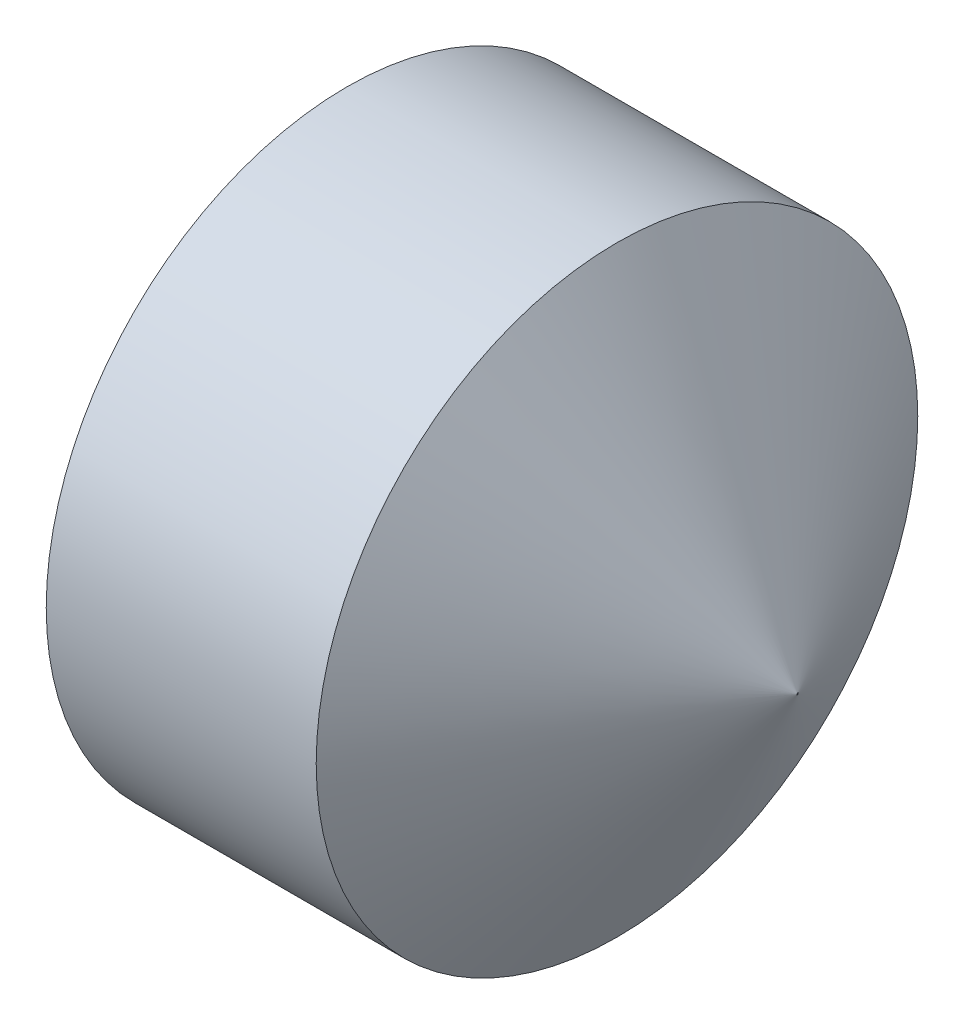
from build123d import *

# Parameters (mm, degrees)
HEX_2_DEPTH = 1.2


with BuildPart() as part:
    # BodySke → BaseBody (revolve)
    with BuildSketch(Plane.XY, mode=Mode.PRIVATE) as basebody_sk:
        Polygon((0, 0), (0, 2.055), (0.25692087, 2.5), (2.500852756, 2.5), (4, 0.005), (4, 0), align=None)
    revolve(basebody_sk.sketch.rotate(Axis((-12.7, 0, 0), (1, 0, 0)), 90), axis=Axis((-12.7, 0, 0), (1, 0, 0)))

    # Sketch2 → Hex 2 (cut)
    with BuildSketch(Plane.ZY):
        Polygon((0.721687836, 1.25), (-0.721687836, 1.25), (-1.443375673, 0), (-0.721687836, -1.25), (0.721687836, -1.25), (1.443375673, 0), align=None)
    extrude(amount=-HEX_2_DEPTH, mode=Mode.SUBTRACT)


solid = part.part
